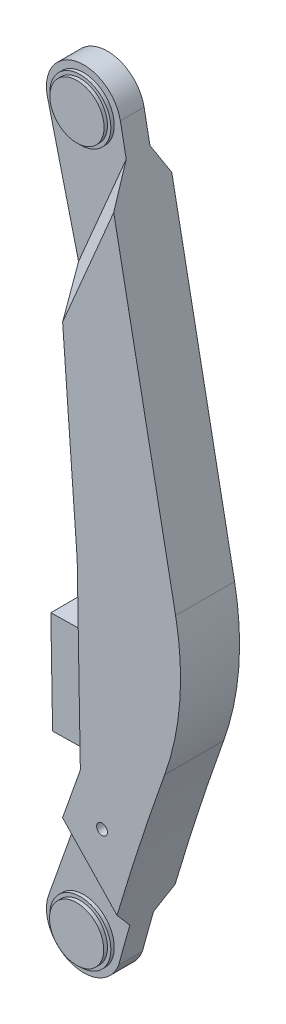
ISO-10303-21;
HEADER;
FILE_DESCRIPTION(('STEP AP214'),'2;1');
FILE_NAME('part.step','',(''),(''),'','','');
FILE_SCHEMA(('AUTOMOTIVE_DESIGN { 1 0 10303 214 1 1 1 1 }'));
ENDSEC;
DATA;
#1=APPLICATION_CONTEXT('core data for automotive mechanical design processes');
#2=APPLICATION_PROTOCOL_DEFINITION('international standard','automotive_design',2000,#1);
#3=PRODUCT_CONTEXT('',#1,'mechanical');
#4=PRODUCT('Part','Part','',(#3));
#5=PRODUCT_RELATED_PRODUCT_CATEGORY('part','',(#4));
#6=PRODUCT_DEFINITION_FORMATION('','',#4);
#7=PRODUCT_DEFINITION_CONTEXT('part definition',#1,'design');
#8=PRODUCT_DEFINITION('design','',#6,#7);
#9=PRODUCT_DEFINITION_SHAPE('','',#8);
#10=(LENGTH_UNIT() NAMED_UNIT(*) SI_UNIT(.MILLI.,.METRE.));
#11=(NAMED_UNIT(*) PLANE_ANGLE_UNIT() SI_UNIT($,.RADIAN.));
#12=(NAMED_UNIT(*) SI_UNIT($,.STERADIAN.) SOLID_ANGLE_UNIT());
#13=UNCERTAINTY_MEASURE_WITH_UNIT(LENGTH_MEASURE(1.E-05),#10,'distance_accuracy_value','');
#14=(GEOMETRIC_REPRESENTATION_CONTEXT(3) GLOBAL_UNCERTAINTY_ASSIGNED_CONTEXT((#13)) GLOBAL_UNIT_ASSIGNED_CONTEXT((#10,
#11,#12)) REPRESENTATION_CONTEXT('',''));
#15=CARTESIAN_POINT('',(0.,0.,0.));
#16=DIRECTION('',(0.,0.,1.));
#17=DIRECTION('',(1.,0.,0.));
#18=AXIS2_PLACEMENT_3D('',#15,#16,#17);
#19=CARTESIAN_POINT('',(52.8827555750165,50.,40.));
#20=DIRECTION('',(0.,0.,1.));
#21=DIRECTION('',(1.,0.,0.));
#22=AXIS2_PLACEMENT_3D('',#19,#20,#21);
#23=PLANE('',#22);
#24=CARTESIAN_POINT('',(52.8827555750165,50.,40.));
#25=DIRECTION('',(0.,0.,1.));
#26=DIRECTION('',(1.,0.,0.));
#27=AXIS2_PLACEMENT_3D('',#24,#25,#26);
#28=CIRCLE('',#27,45.);
#29=CARTESIAN_POINT('',(97.8827555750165,50.,40.));
#30=VERTEX_POINT('',#29);
#31=EDGE_CURVE('E247',#30,#30,#28,.T.);
#32=ORIENTED_EDGE('',*,*,#31,.T.);
#33=EDGE_LOOP('',(#32));
#34=FACE_BOUND('',#33,.T.);
#35=CARTESIAN_POINT('',(52.8827555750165,50.,40.));
#36=DIRECTION('',(0.,0.,1.));
#37=DIRECTION('',(1.,0.,0.));
#38=AXIS2_PLACEMENT_3D('',#35,#36,#37);
#39=CIRCLE('',#38,40.);
#40=CARTESIAN_POINT('',(92.8827555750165,50.,40.));
#41=VERTEX_POINT('',#40);
#42=EDGE_CURVE('E425',#41,#41,#39,.T.);
#43=ORIENTED_EDGE('',*,*,#42,.F.);
#44=EDGE_LOOP('',(#43));
#45=FACE_BOUND('',#44,.T.);
#46=ADVANCED_FACE('F15',(#34,#45),#23,.T.);
#47=CARTESIAN_POINT('',(52.8827555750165,50.,-5.));
#48=DIRECTION('',(0.,0.,1.));
#49=DIRECTION('',(1.,0.,0.));
#50=AXIS2_PLACEMENT_3D('',#47,#48,#49);
#51=PLANE('',#50);
#52=CARTESIAN_POINT('',(52.8827555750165,50.,-5.));
#53=DIRECTION('',(0.,0.,1.));
#54=DIRECTION('',(1.,0.,0.));
#55=AXIS2_PLACEMENT_3D('',#52,#53,#54);
#56=CIRCLE('',#55,45.);
#57=CARTESIAN_POINT('',(97.8827555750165,50.,-5.));
#58=VERTEX_POINT('',#57);
#59=EDGE_CURVE('E244',#58,#58,#56,.T.);
#60=ORIENTED_EDGE('',*,*,#59,.F.);
#61=EDGE_LOOP('',(#60));
#62=FACE_BOUND('',#61,.T.);
#63=CARTESIAN_POINT('',(52.8827555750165,50.,-5.));
#64=DIRECTION('',(0.,0.,1.));
#65=DIRECTION('',(1.,0.,0.));
#66=AXIS2_PLACEMENT_3D('',#63,#64,#65);
#67=CIRCLE('',#66,40.);
#68=CARTESIAN_POINT('',(92.8827555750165,50.,-5.));
#69=VERTEX_POINT('',#68);
#70=EDGE_CURVE('E9',#69,#69,#67,.F.);
#71=ORIENTED_EDGE('',*,*,#70,.F.);
#72=EDGE_LOOP('',(#71));
#73=FACE_BOUND('',#72,.T.);
#74=ADVANCED_FACE('F367',(#62,#73),#51,.F.);
#75=CARTESIAN_POINT('',(52.8827555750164,1100.,40.));
#76=DIRECTION('',(0.,0.,1.));
#77=DIRECTION('',(1.,0.,0.));
#78=AXIS2_PLACEMENT_3D('',#75,#76,#77);
#79=PLANE('',#78);
#80=CARTESIAN_POINT('',(52.8827555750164,1100.,40.));
#81=DIRECTION('',(0.,0.,1.));
#82=DIRECTION('',(1.,0.,0.));
#83=AXIS2_PLACEMENT_3D('',#80,#81,#82);
#84=CIRCLE('',#83,45.);
#85=CARTESIAN_POINT('',(97.8827555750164,1100.,40.));
#86=VERTEX_POINT('',#85);
#87=EDGE_CURVE('E259',#86,#86,#84,.T.);
#88=ORIENTED_EDGE('',*,*,#87,.T.);
#89=EDGE_LOOP('',(#88));
#90=FACE_BOUND('',#89,.T.);
#91=CARTESIAN_POINT('',(52.8827555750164,1100.,40.));
#92=DIRECTION('',(0.,0.,1.));
#93=DIRECTION('',(1.,0.,0.));
#94=AXIS2_PLACEMENT_3D('',#91,#92,#93);
#95=CIRCLE('',#94,40.);
#96=CARTESIAN_POINT('',(92.8827555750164,1100.,40.));
#97=VERTEX_POINT('',#96);
#98=EDGE_CURVE('E428',#97,#97,#95,.T.);
#99=ORIENTED_EDGE('',*,*,#98,.F.);
#100=EDGE_LOOP('',(#99));
#101=FACE_BOUND('',#100,.T.);
#102=ADVANCED_FACE('F355',(#90,#101),#79,.T.);
#103=CARTESIAN_POINT('',(52.8827555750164,1100.,-5.));
#104=DIRECTION('',(0.,0.,1.));
#105=DIRECTION('',(1.,0.,0.));
#106=AXIS2_PLACEMENT_3D('',#103,#104,#105);
#107=PLANE('',#106);
#108=CARTESIAN_POINT('',(52.8827555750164,1100.,-5.));
#109=DIRECTION('',(0.,0.,1.));
#110=DIRECTION('',(1.,0.,0.));
#111=AXIS2_PLACEMENT_3D('',#108,#109,#110);
#112=CIRCLE('',#111,45.);
#113=CARTESIAN_POINT('',(97.8827555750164,1100.,-5.));
#114=VERTEX_POINT('',#113);
#115=EDGE_CURVE('E256',#114,#114,#112,.T.);
#116=ORIENTED_EDGE('',*,*,#115,.F.);
#117=EDGE_LOOP('',(#116));
#118=FACE_BOUND('',#117,.T.);
#119=CARTESIAN_POINT('',(52.8827555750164,1100.,-5.));
#120=DIRECTION('',(0.,0.,1.));
#121=DIRECTION('',(1.,0.,0.));
#122=AXIS2_PLACEMENT_3D('',#119,#120,#121);
#123=CIRCLE('',#122,40.);
#124=CARTESIAN_POINT('',(92.8827555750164,1100.,-5.));
#125=VERTEX_POINT('',#124);
#126=EDGE_CURVE('E24',#125,#125,#123,.F.);
#127=ORIENTED_EDGE('',*,*,#126,.F.);
#128=EDGE_LOOP('',(#127));
#129=FACE_BOUND('',#128,.T.);
#130=ADVANCED_FACE('F353',(#118,#129),#107,.F.);
#131=CARTESIAN_POINT('',(71.231981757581,546.158587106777,35.));
#132=DIRECTION('',(0.999847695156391,0.0174524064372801,0.));
#133=DIRECTION('',(-0.0174524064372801,0.999847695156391,0.));
#134=AXIS2_PLACEMENT_3D('',#131,#132,#133);
#135=PLANE('',#134);
#136=DIRECTION('',(0.,0.,-1.));
#137=VECTOR('',#136,1.);
#138=CARTESIAN_POINT('',(71.231981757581,546.158587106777,35.));
#139=LINE('',#138,#137);
#140=CARTESIAN_POINT('',(71.2319817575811,546.158587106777,63.));
#141=VERTEX_POINT('',#140);
#142=CARTESIAN_POINT('',(71.2319817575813,546.158587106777,-24.));
#143=VERTEX_POINT('',#142);
#144=EDGE_CURVE('E307',#141,#143,#139,.T.);
#145=ORIENTED_EDGE('',*,*,#144,.T.);
#146=DIRECTION('',(0.0174524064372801,-0.999847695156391,0.));
#147=VECTOR('',#146,1.);
#148=CARTESIAN_POINT('',(71.2319817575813,546.158587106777,-24.));
#149=LINE('',#148,#147);
#150=CARTESIAN_POINT('',(75.8827555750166,279.715933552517,-24.));
#151=VERTEX_POINT('',#150);
#152=EDGE_CURVE('E225',#143,#151,#149,.T.);
#153=ORIENTED_EDGE('',*,*,#152,.T.);
#154=DIRECTION('',(0.,0.,-1.));
#155=VECTOR('',#154,1.);
#156=CARTESIAN_POINT('',(75.8827555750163,279.715933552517,35.));
#157=LINE('',#156,#155);
#158=CARTESIAN_POINT('',(75.8827555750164,279.715933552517,63.));
#159=VERTEX_POINT('',#158);
#160=EDGE_CURVE('E305',#159,#151,#157,.T.);
#161=ORIENTED_EDGE('',*,*,#160,.F.);
#162=DIRECTION('',(0.0174524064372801,-0.999847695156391,0.));
#163=VECTOR('',#162,1.);
#164=CARTESIAN_POINT('',(71.2319817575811,546.158587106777,63.));
#165=LINE('',#164,#163);
#166=EDGE_CURVE('E209',#141,#159,#165,.T.);
#167=ORIENTED_EDGE('',*,*,#166,.F.);
#168=EDGE_LOOP('',(#145,#153,#161,#167));
#169=FACE_BOUND('',#168,.T.);
#170=DIRECTION('',(-0.0174524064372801,0.999847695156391,0.));
#171=VECTOR('',#170,1.);
#172=CARTESIAN_POINT('',(72.8204454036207,455.155565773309,58.5));
#173=LINE('',#172,#171);
#174=CARTESIAN_POINT('',(75.4383063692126,305.17841149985,58.5));
#175=VERTEX_POINT('',#174);
#176=CARTESIAN_POINT('',(72.8204454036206,455.155565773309,58.5));
#177=VERTEX_POINT('',#176);
#178=EDGE_CURVE('E155',#175,#177,#173,.T.);
#179=ORIENTED_EDGE('',*,*,#178,.F.);
#180=DIRECTION('',(0.,0.,1.));
#181=VECTOR('',#180,1.);
#182=CARTESIAN_POINT('',(75.4383063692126,305.17841149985,58.5));
#183=LINE('',#182,#181);
#184=CARTESIAN_POINT('',(75.4383063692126,305.17841149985,8.5));
#185=VERTEX_POINT('',#184);
#186=EDGE_CURVE('E158',#185,#175,#183,.T.);
#187=ORIENTED_EDGE('',*,*,#186,.F.);
#188=DIRECTION('',(0.0174524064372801,-0.999847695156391,0.));
#189=VECTOR('',#188,1.);
#190=CARTESIAN_POINT('',(72.8204454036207,455.155565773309,8.5));
#191=LINE('',#190,#189);
#192=CARTESIAN_POINT('',(72.8204454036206,455.155565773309,8.5));
#193=VERTEX_POINT('',#192);
#194=EDGE_CURVE('E36',#193,#185,#191,.T.);
#195=ORIENTED_EDGE('',*,*,#194,.F.);
#196=DIRECTION('',(0.,0.,-1.));
#197=VECTOR('',#196,1.);
#198=CARTESIAN_POINT('',(72.8204454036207,455.155565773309,58.5));
#199=LINE('',#198,#197);
#200=EDGE_CURVE('E31',#177,#193,#199,.T.);
#201=ORIENTED_EDGE('',*,*,#200,.F.);
#202=EDGE_LOOP('',(#179,#187,#195,#201));
#203=FACE_BOUND('',#202,.T.);
#204=ADVANCED_FACE('F157',(#169,#203),#135,.F.);
#205=CARTESIAN_POINT('',(52.8827555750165,1100.,35.));
#206=DIRECTION('',(0.,0.,-1.));
#207=DIRECTION('',(-1.,0.,0.));
#208=AXIS2_PLACEMENT_3D('',#205,#206,#207);
#209=PLANE('',#208);
#210=CARTESIAN_POINT('',(52.8827555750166,50.,35.));
#211=DIRECTION('',(0.,0.,-1.));
#212=DIRECTION('',(-1.,0.,0.));
#213=AXIS2_PLACEMENT_3D('',#210,#211,#212);
#214=CIRCLE('',#213,45.);
#215=CARTESIAN_POINT('',(7.8827555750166,50.,35.));
#216=VERTEX_POINT('',#215);
#217=EDGE_CURVE('E251',#216,#216,#214,.F.);
#218=ORIENTED_EDGE('',*,*,#217,.F.);
#219=EDGE_LOOP('',(#218));
#220=FACE_BOUND('',#219,.T.);
#221=CARTESIAN_POINT('',(3965.40296443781,-1014.56231606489,35.));
#222=DIRECTION('',(0.,0.,-1.));
#223=DIRECTION('',(-1.,0.,0.));
#224=AXIS2_PLACEMENT_3D('',#221,#222,#223);
#225=CIRCLE('',#224,4000.);
#226=CARTESIAN_POINT('',(104.399725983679,30.738594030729,35.));
#227=VERTEX_POINT('',#226);
#228=CARTESIAN_POINT('',(120.933938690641,90.,35.));
#229=VERTEX_POINT('',#228);
#230=EDGE_CURVE('E291',#227,#229,#225,.T.);
#231=ORIENTED_EDGE('',*,*,#230,.T.);
#232=DIRECTION('',(-0.688952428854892,0.724806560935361,0.));
#233=VECTOR('',#232,1.);
#234=CARTESIAN_POINT('',(-415.717739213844,654.579847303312,35.));
#235=LINE('',#234,#233);
#236=CARTESIAN_POINT('',(39.1640010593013,176.025369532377,35.));
#237=VERTEX_POINT('',#236);
#238=EDGE_CURVE('E242',#229,#237,#235,.T.);
#239=ORIENTED_EDGE('',*,*,#238,.T.);
#240=DIRECTION('',(-0.333806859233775,-0.942641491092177,0.));
#241=VECTOR('',#240,1.);
#242=CARTESIAN_POINT('',(75.8827555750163,279.715933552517,35.));
#243=LINE('',#242,#241);
#244=CARTESIAN_POINT('',(1.03747356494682,68.3593772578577,35.));
#245=VERTEX_POINT('',#244);
#246=EDGE_CURVE('E287',#237,#245,#243,.T.);
#247=ORIENTED_EDGE('',*,*,#246,.T.);
#248=CARTESIAN_POINT('',(52.8827555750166,50.,35.));
#249=DIRECTION('',(0.,0.,1.));
#250=DIRECTION('',(1.,0.,0.));
#251=AXIS2_PLACEMENT_3D('',#248,#249,#250);
#252=CIRCLE('',#251,55.);
#253=EDGE_CURVE('E289',#245,#227,#252,.T.);
#254=ORIENTED_EDGE('',*,*,#253,.T.);
#255=EDGE_LOOP('',(#231,#239,#247,#254));
#256=FACE_BOUND('',#255,.T.);
#257=ADVANCED_FACE('F364',(#220,#256),#209,.F.);
#258=CARTESIAN_POINT('',(52.8827555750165,1100.,0.));
#259=DIRECTION('',(0.,0.,-1.));
#260=DIRECTION('',(-1.,0.,0.));
#261=AXIS2_PLACEMENT_3D('',#258,#259,#260);
#262=PLANE('',#261);
#263=DIRECTION('',(-0.688952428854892,0.724806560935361,0.));
#264=VECTOR('',#263,1.);
#265=CARTESIAN_POINT('',(-415.717739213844,654.579847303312,0.));
#266=LINE('',#265,#264);
#267=CARTESIAN_POINT('',(120.933938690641,90.,0.));
#268=VERTEX_POINT('',#267);
#269=CARTESIAN_POINT('',(39.1640010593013,176.025369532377,0.));
#270=VERTEX_POINT('',#269);
#271=EDGE_CURVE('E239',#268,#270,#266,.T.);
#272=ORIENTED_EDGE('',*,*,#271,.F.);
#273=CARTESIAN_POINT('',(3965.40296443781,-1014.56231606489,0.));
#274=DIRECTION('',(0.,0.,-1.));
#275=DIRECTION('',(-1.,0.,0.));
#276=AXIS2_PLACEMENT_3D('',#273,#274,#275);
#277=CIRCLE('',#276,4000.);
#278=CARTESIAN_POINT('',(104.399725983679,30.738594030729,0.));
#279=VERTEX_POINT('',#278);
#280=EDGE_CURVE('E276',#279,#268,#277,.T.);
#281=ORIENTED_EDGE('',*,*,#280,.F.);
#282=CARTESIAN_POINT('',(52.8827555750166,50.,0.));
#283=DIRECTION('',(0.,0.,1.));
#284=DIRECTION('',(1.,0.,0.));
#285=AXIS2_PLACEMENT_3D('',#282,#283,#284);
#286=CIRCLE('',#285,55.);
#287=CARTESIAN_POINT('',(1.03747356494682,68.3593772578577,0.));
#288=VERTEX_POINT('',#287);
#289=EDGE_CURVE('E274',#288,#279,#286,.T.);
#290=ORIENTED_EDGE('',*,*,#289,.F.);
#291=DIRECTION('',(-0.333806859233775,-0.942641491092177,0.));
#292=VECTOR('',#291,1.);
#293=CARTESIAN_POINT('',(75.8827555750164,279.715933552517,0.));
#294=LINE('',#293,#292);
#295=EDGE_CURVE('E272',#270,#288,#294,.T.);
#296=ORIENTED_EDGE('',*,*,#295,.F.);
#297=EDGE_LOOP('',(#272,#281,#290,#296));
#298=FACE_BOUND('',#297,.T.);
#299=CARTESIAN_POINT('',(52.8827555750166,50.,0.));
#300=DIRECTION('',(0.,0.,-1.));
#301=DIRECTION('',(-1.,0.,0.));
#302=AXIS2_PLACEMENT_3D('',#299,#300,#301);
#303=CIRCLE('',#302,45.);
#304=CARTESIAN_POINT('',(7.8827555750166,50.,0.));
#305=VERTEX_POINT('',#304);
#306=EDGE_CURVE('E250',#305,#305,#303,.F.);
#307=ORIENTED_EDGE('',*,*,#306,.T.);
#308=EDGE_LOOP('',(#307));
#309=FACE_BOUND('',#308,.T.);
#310=ADVANCED_FACE('F520',(#298,#309),#262,.T.);
#311=CARTESIAN_POINT('',(52.8827555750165,1100.,35.));
#312=DIRECTION('',(0.,0.,-1.));
#313=DIRECTION('',(-1.,0.,0.));
#314=AXIS2_PLACEMENT_3D('',#311,#312,#313);
#315=CIRCLE('',#314,45.);
#316=CARTESIAN_POINT('',(7.88275557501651,1100.,35.));
#317=VERTEX_POINT('',#316);
#318=EDGE_CURVE('E255',#317,#317,#315,.F.);
#319=ORIENTED_EDGE('',*,*,#318,.F.);
#320=EDGE_LOOP('',(#319));
#321=FACE_BOUND('',#320,.T.);
#322=DIRECTION('',(0.23791992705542,-0.971284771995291,0.));
#323=VECTOR('',#322,1.);
#324=CARTESIAN_POINT('',(-0.537906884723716,1086.91440401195,35.));
#325=LINE('',#324,#323);
#326=CARTESIAN_POINT('',(-0.537906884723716,1086.91440401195,35.));
#327=VERTEX_POINT('',#326);
#328=CARTESIAN_POINT('',(45.2474926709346,900.,35.));
#329=VERTEX_POINT('',#328);
#330=EDGE_CURVE('E284',#327,#329,#325,.T.);
#331=ORIENTED_EDGE('',*,*,#330,.T.);
#332=DIRECTION('',(0.390731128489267,0.920504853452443,0.));
#333=VECTOR('',#332,1.);
#334=CARTESIAN_POINT('',(118.347154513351,1072.21201129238,35.));
#335=LINE('',#334,#333);
#336=CARTESIAN_POINT('',(115.580533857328,1065.69426147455,35.));
#337=VERTEX_POINT('',#336);
#338=EDGE_CURVE('E236',#329,#337,#335,.T.);
#339=ORIENTED_EDGE('',*,*,#338,.T.);
#340=DIRECTION('',(-0.190808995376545,0.981627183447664,0.));
#341=VECTOR('',#340,1.);
#342=CARTESIAN_POINT('',(106.872250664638,1110.49449474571,35.));
#343=LINE('',#342,#341);
#344=CARTESIAN_POINT('',(106.872250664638,1110.49449474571,35.));
#345=VERTEX_POINT('',#344);
#346=EDGE_CURVE('E294',#337,#345,#343,.T.);
#347=ORIENTED_EDGE('',*,*,#346,.T.);
#348=CARTESIAN_POINT('',(52.8827555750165,1100.,35.));
#349=DIRECTION('',(0.,0.,1.));
#350=DIRECTION('',(-1.,0.,0.));
#351=AXIS2_PLACEMENT_3D('',#348,#349,#350);
#352=CIRCLE('',#351,55.);
#353=EDGE_CURVE('E281',#345,#327,#352,.T.);
#354=ORIENTED_EDGE('',*,*,#353,.T.);
#355=EDGE_LOOP('',(#331,#339,#347,#354));
#356=FACE_BOUND('',#355,.T.);
#357=ADVANCED_FACE('F560',(#321,#356),#209,.F.);
#358=DIRECTION('',(0.390731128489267,0.920504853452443,0.));
#359=VECTOR('',#358,1.);
#360=CARTESIAN_POINT('',(118.347154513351,1072.21201129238,0.));
#361=LINE('',#360,#359);
#362=CARTESIAN_POINT('',(45.2474926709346,900.,0.));
#363=VERTEX_POINT('',#362);
#364=CARTESIAN_POINT('',(115.580533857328,1065.69426147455,0.));
#365=VERTEX_POINT('',#364);
#366=EDGE_CURVE('E233',#363,#365,#361,.T.);
#367=ORIENTED_EDGE('',*,*,#366,.F.);
#368=DIRECTION('',(0.23791992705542,-0.971284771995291,0.));
#369=VECTOR('',#368,1.);
#370=CARTESIAN_POINT('',(-0.537906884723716,1086.91440401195,0.));
#371=LINE('',#370,#369);
#372=CARTESIAN_POINT('',(-0.537906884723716,1086.91440401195,0.));
#373=VERTEX_POINT('',#372);
#374=EDGE_CURVE('E269',#373,#363,#371,.T.);
#375=ORIENTED_EDGE('',*,*,#374,.F.);
#376=CARTESIAN_POINT('',(52.8827555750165,1100.,0.));
#377=DIRECTION('',(0.,0.,1.));
#378=DIRECTION('',(-1.,0.,0.));
#379=AXIS2_PLACEMENT_3D('',#376,#377,#378);
#380=CIRCLE('',#379,55.);
#381=CARTESIAN_POINT('',(106.872250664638,1110.49449474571,0.));
#382=VERTEX_POINT('',#381);
#383=EDGE_CURVE('E266',#382,#373,#380,.T.);
#384=ORIENTED_EDGE('',*,*,#383,.F.);
#385=DIRECTION('',(-0.190808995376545,0.981627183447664,0.));
#386=VECTOR('',#385,1.);
#387=CARTESIAN_POINT('',(106.872250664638,1110.49449474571,0.));
#388=LINE('',#387,#386);
#389=EDGE_CURVE('E279',#365,#382,#388,.T.);
#390=ORIENTED_EDGE('',*,*,#389,.F.);
#391=EDGE_LOOP('',(#367,#375,#384,#390));
#392=FACE_BOUND('',#391,.T.);
#393=CARTESIAN_POINT('',(52.8827555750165,1100.,0.));
#394=DIRECTION('',(0.,0.,-1.));
#395=DIRECTION('',(-1.,0.,0.));
#396=AXIS2_PLACEMENT_3D('',#393,#394,#395);
#397=CIRCLE('',#396,45.);
#398=CARTESIAN_POINT('',(7.88275557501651,1100.,0.));
#399=VERTEX_POINT('',#398);
#400=EDGE_CURVE('E262',#399,#399,#397,.F.);
#401=ORIENTED_EDGE('',*,*,#400,.T.);
#402=EDGE_LOOP('',(#401));
#403=FACE_BOUND('',#402,.T.);
#404=ADVANCED_FACE('F551',(#392,#403),#262,.T.);
#405=CARTESIAN_POINT('',(52.8827555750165,1100.,35.));
#406=DIRECTION('',(0.,0.,-1.));
#407=DIRECTION('',(-1.,0.,0.));
#408=AXIS2_PLACEMENT_3D('',#405,#406,#407);
#409=CYLINDRICAL_SURFACE('',#408,55.);
#410=ORIENTED_EDGE('',*,*,#383,.T.);
#411=DIRECTION('',(0.,0.,-1.));
#412=VECTOR('',#411,1.);
#413=CARTESIAN_POINT('',(-0.537906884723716,1086.91440401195,35.));
#414=LINE('',#413,#412);
#415=EDGE_CURVE('E313',#327,#373,#414,.T.);
#416=ORIENTED_EDGE('',*,*,#415,.F.);
#417=ORIENTED_EDGE('',*,*,#353,.F.);
#418=DIRECTION('',(0.,0.,-1.));
#419=VECTOR('',#418,1.);
#420=CARTESIAN_POINT('',(106.872250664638,1110.49449474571,35.));
#421=LINE('',#420,#419);
#422=EDGE_CURVE('E296',#345,#382,#421,.T.);
#423=ORIENTED_EDGE('',*,*,#422,.T.);
#424=EDGE_LOOP('',(#410,#416,#417,#423));
#425=FACE_BOUND('',#424,.T.);
#426=ADVANCED_FACE('F17',(#425),#409,.T.);
#427=CARTESIAN_POINT('',(-0.537906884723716,1086.91440401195,35.));
#428=DIRECTION('',(0.971284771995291,0.23791992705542,0.));
#429=DIRECTION('',(-0.23791992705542,0.971284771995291,0.));
#430=AXIS2_PLACEMENT_3D('',#427,#428,#429);
#431=PLANE('',#430);
#432=ORIENTED_EDGE('',*,*,#374,.T.);
#433=DIRECTION('',(0.,0.,-1.));
#434=VECTOR('',#433,1.);
#435=CARTESIAN_POINT('',(45.2474926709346,900.,35.));
#436=LINE('',#435,#434);
#437=EDGE_CURVE('E310',#329,#363,#436,.T.);
#438=ORIENTED_EDGE('',*,*,#437,.F.);
#439=ORIENTED_EDGE('',*,*,#330,.F.);
#440=ORIENTED_EDGE('',*,*,#415,.T.);
#441=EDGE_LOOP('',(#432,#438,#439,#440));
#442=FACE_BOUND('',#441,.T.);
#443=ADVANCED_FACE('F565',(#442),#431,.F.);
#444=CARTESIAN_POINT('',(45.2474926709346,900.,35.));
#445=DIRECTION('',(0.997314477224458,0.0732381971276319,0.));
#446=DIRECTION('',(-0.0732381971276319,0.997314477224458,0.));
#447=AXIS2_PLACEMENT_3D('',#444,#445,#446);
#448=PLANE('',#447);
#449=DIRECTION('',(0.0732381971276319,-0.997314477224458,0.));
#450=VECTOR('',#449,1.);
#451=CARTESIAN_POINT('',(45.2474926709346,900.,63.));
#452=LINE('',#451,#450);
#453=CARTESIAN_POINT('',(49.7337731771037,838.908483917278,63.));
#454=VERTEX_POINT('',#453);
#455=EDGE_CURVE('E207',#454,#141,#452,.T.);
#456=ORIENTED_EDGE('',*,*,#455,.F.);
#457=DIRECTION('',(0.0666094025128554,-0.907047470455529,0.415725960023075));
#458=VECTOR('',#457,1.);
#459=CARTESIAN_POINT('',(72.7469435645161,525.5287327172,206.630958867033));
#460=LINE('',#459,#458);
#461=EDGE_CURVE('E341',#454,#329,#460,.F.);
#462=ORIENTED_EDGE('',*,*,#461,.T.);
#463=ORIENTED_EDGE('',*,*,#437,.T.);
#464=DIRECTION('',(0.0666094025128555,-0.90704747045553,-0.415725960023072));
#465=VECTOR('',#464,1.);
#466=CARTESIAN_POINT('',(35.5486495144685,1032.0731130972,60.5329087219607));
#467=LINE('',#466,#465);
#468=CARTESIAN_POINT('',(49.0928759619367,847.635843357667,-24.));
#469=VERTEX_POINT('',#468);
#470=EDGE_CURVE('E331',#363,#469,#467,.T.);
#471=ORIENTED_EDGE('',*,*,#470,.T.);
#472=DIRECTION('',(0.0732381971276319,-0.997314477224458,0.));
#473=VECTOR('',#472,1.);
#474=CARTESIAN_POINT('',(45.2474926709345,900.,-24.));
#475=LINE('',#474,#473);
#476=EDGE_CURVE('E223',#469,#143,#475,.T.);
#477=ORIENTED_EDGE('',*,*,#476,.T.);
#478=ORIENTED_EDGE('',*,*,#144,.F.);
#479=EDGE_LOOP('',(#456,#462,#463,#471,#477,#478));
#480=FACE_BOUND('',#479,.T.);
#481=ADVANCED_FACE('F563',(#480),#448,.F.);
#482=CARTESIAN_POINT('',(75.8827555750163,279.715933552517,35.));
#483=DIRECTION('',(0.942641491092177,-0.333806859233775,0.));
#484=DIRECTION('',(0.333806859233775,0.942641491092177,0.));
#485=AXIS2_PLACEMENT_3D('',#482,#483,#484);
#486=PLANE('',#485);
#487=ORIENTED_EDGE('',*,*,#246,.F.);
#488=DIRECTION('',(-0.249181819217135,-0.703667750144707,-0.665402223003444));
#489=VECTOR('',#488,1.);
#490=CARTESIAN_POINT('',(78.9799095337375,288.462026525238,141.322339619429));
#491=LINE('',#490,#489);
#492=CARTESIAN_POINT('',(49.6495249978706,205.635575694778,63.));
#493=VERTEX_POINT('',#492);
#494=EDGE_CURVE('E347',#237,#493,#491,.F.);
#495=ORIENTED_EDGE('',*,*,#494,.T.);
#496=DIRECTION('',(-0.333806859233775,-0.942641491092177,0.));
#497=VECTOR('',#496,1.);
#498=CARTESIAN_POINT('',(75.8827555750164,279.715933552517,63.));
#499=LINE('',#498,#497);
#500=EDGE_CURVE('E212',#159,#493,#499,.T.);
#501=ORIENTED_EDGE('',*,*,#500,.F.);
#502=ORIENTED_EDGE('',*,*,#160,.T.);
#503=DIRECTION('',(-0.333806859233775,-0.942641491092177,0.));
#504=VECTOR('',#503,1.);
#505=CARTESIAN_POINT('',(75.8827555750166,279.715933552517,-24.));
#506=LINE('',#505,#504);
#507=CARTESIAN_POINT('',(48.1515930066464,201.405546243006,-24.));
#508=VERTEX_POINT('',#507);
#509=EDGE_CURVE('E228',#151,#508,#506,.T.);
#510=ORIENTED_EDGE('',*,*,#509,.T.);
#511=DIRECTION('',(-0.249181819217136,-0.703667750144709,0.665402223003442));
#512=VECTOR('',#511,1.);
#513=CARTESIAN_POINT('',(29.157433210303,147.767693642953,26.7210204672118));
#514=LINE('',#513,#512);
#515=EDGE_CURVE('E329',#508,#270,#514,.T.);
#516=ORIENTED_EDGE('',*,*,#515,.T.);
#517=ORIENTED_EDGE('',*,*,#295,.T.);
#518=DIRECTION('',(0.,0.,-1.));
#519=VECTOR('',#518,1.);
#520=CARTESIAN_POINT('',(1.03747356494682,68.3593772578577,35.));
#521=LINE('',#520,#519);
#522=EDGE_CURVE('E302',#245,#288,#521,.T.);
#523=ORIENTED_EDGE('',*,*,#522,.F.);
#524=EDGE_LOOP('',(#487,#495,#501,#502,#510,#516,#517,#523));
#525=FACE_BOUND('',#524,.T.);
#526=ADVANCED_FACE('F516',(#525),#486,.F.);
#527=CARTESIAN_POINT('',(52.8827555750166,50.,35.));
#528=DIRECTION('',(0.,0.,-1.));
#529=DIRECTION('',(-1.,0.,0.));
#530=AXIS2_PLACEMENT_3D('',#527,#528,#529);
#531=CYLINDRICAL_SURFACE('',#530,55.);
#532=ORIENTED_EDGE('',*,*,#289,.T.);
#533=DIRECTION('',(0.,0.,-1.));
#534=VECTOR('',#533,1.);
#535=CARTESIAN_POINT('',(104.399725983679,30.738594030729,35.));
#536=LINE('',#535,#534);
#537=EDGE_CURVE('E299',#227,#279,#536,.T.);
#538=ORIENTED_EDGE('',*,*,#537,.F.);
#539=ORIENTED_EDGE('',*,*,#253,.F.);
#540=ORIENTED_EDGE('',*,*,#522,.T.);
#541=EDGE_LOOP('',(#532,#538,#539,#540));
#542=FACE_BOUND('',#541,.T.);
#543=ADVANCED_FACE('F525',(#542),#531,.T.);
#544=CARTESIAN_POINT('',(3965.40296443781,-1014.56231606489,35.));
#545=DIRECTION('',(0.,0.,-1.));
#546=DIRECTION('',(-1.,0.,0.));
#547=AXIS2_PLACEMENT_3D('',#544,#545,#546);
#548=CYLINDRICAL_SURFACE('',#547,4000.);
#549=CARTESIAN_POINT('',(3965.40296443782,-1014.56231606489,63.));
#550=DIRECTION('',(0.,0.,-1.));
#551=DIRECTION('',(1.,0.,0.));
#552=AXIS2_PLACEMENT_3D('',#549,#550,#551);
#553=CIRCLE('',#552,4000.);
#554=CARTESIAN_POINT('',(130.005251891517,121.098014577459,63.));
#555=VERTEX_POINT('',#554);
#556=CARTESIAN_POINT('',(200.236073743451,335.814773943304,63.));
#557=VERTEX_POINT('',#556);
#558=EDGE_CURVE('E215',#555,#557,#553,.T.);
#559=ORIENTED_EDGE('',*,*,#558,.F.);
#560=CARTESIAN_POINT('',(3965.40296443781,-1014.56231606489,2060.50548269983));
#561=DIRECTION('',(0.512515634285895,0.487162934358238,-0.707106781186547));
#562=DIRECTION('',(-0.512515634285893,-0.487162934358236,-0.707106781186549));
#563=AXIS2_PLACEMENT_3D('',#560,#561,#562);
#564=ELLIPSE('',#563,5656.85424949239,4000.);
#565=EDGE_CURVE('E345',#555,#229,#564,.F.);
#566=ORIENTED_EDGE('',*,*,#565,.T.);
#567=ORIENTED_EDGE('',*,*,#230,.F.);
#568=ORIENTED_EDGE('',*,*,#537,.T.);
#569=ORIENTED_EDGE('',*,*,#280,.T.);
#570=CARTESIAN_POINT('',(3965.40296443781,-1014.56231606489,-2025.50548269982));
#571=DIRECTION('',(-0.512515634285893,-0.487162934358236,-0.707106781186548));
#572=DIRECTION('',(0.512515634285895,0.487162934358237,-0.707106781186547));
#573=AXIS2_PLACEMENT_3D('',#570,#571,#572);
#574=ELLIPSE('',#573,5656.85424949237,4000.);
#575=CARTESIAN_POINT('',(128.696569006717,116.668887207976,-24.));
#576=VERTEX_POINT('',#575);
#577=EDGE_CURVE('E254',#268,#576,#574,.T.);
#578=ORIENTED_EDGE('',*,*,#577,.T.);
#579=CARTESIAN_POINT('',(3965.40296443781,-1014.56231606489,-24.));
#580=DIRECTION('',(0.,0.,-1.));
#581=DIRECTION('',(1.,0.,0.));
#582=AXIS2_PLACEMENT_3D('',#579,#580,#581);
#583=CIRCLE('',#582,4000.);
#584=CARTESIAN_POINT('',(200.236073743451,335.814773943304,-24.));
#585=VERTEX_POINT('',#584);
#586=EDGE_CURVE('E231',#576,#585,#583,.T.);
#587=ORIENTED_EDGE('',*,*,#586,.T.);
#588=DIRECTION('',(0.,0.,-1.));
#589=VECTOR('',#588,1.);
#590=CARTESIAN_POINT('',(200.23607374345,335.814773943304,35.));
#591=LINE('',#590,#589);
#592=EDGE_CURVE('E265',#585,#557,#591,.F.);
#593=ORIENTED_EDGE('',*,*,#592,.T.);
#594=EDGE_LOOP('',(#559,#566,#567,#568,#569,#578,#587,#593));
#595=FACE_BOUND('',#594,.T.);
#596=ADVANCED_FACE('F529',(#595),#548,.F.);
#597=CARTESIAN_POINT('',(106.872250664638,1110.49449474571,35.));
#598=DIRECTION('',(-0.981627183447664,-0.190808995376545,0.));
#599=DIRECTION('',(0.190808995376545,-0.981627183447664,0.));
#600=AXIS2_PLACEMENT_3D('',#597,#598,#599);
#601=PLANE('',#600);
#602=ORIENTED_EDGE('',*,*,#346,.F.);
#603=DIRECTION('',(-0.166539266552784,0.85677025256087,-0.488067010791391));
#604=VECTOR('',#603,1.);
#605=CARTESIAN_POINT('',(199.858386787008,632.122294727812,281.988236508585));
#606=LINE('',#605,#604);
#607=CARTESIAN_POINT('',(125.134753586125,1016.5420619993,63.));
#608=VERTEX_POINT('',#607);
#609=EDGE_CURVE('E343',#337,#608,#606,.F.);
#610=ORIENTED_EDGE('',*,*,#609,.T.);
#611=DIRECTION('',(-0.190808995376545,0.981627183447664,0.));
#612=VECTOR('',#611,1.);
#613=CARTESIAN_POINT('',(216.370258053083,547.176081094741,63.));
#614=LINE('',#613,#612);
#615=CARTESIAN_POINT('',(216.370258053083,547.176081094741,63.));
#616=VERTEX_POINT('',#615);
#617=EDGE_CURVE('E204',#616,#608,#614,.T.);
#618=ORIENTED_EDGE('',*,*,#617,.F.);
#619=DIRECTION('',(0.,0.,-1.));
#620=VECTOR('',#619,1.);
#621=CARTESIAN_POINT('',(216.370258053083,547.176081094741,35.));
#622=LINE('',#621,#620);
#623=CARTESIAN_POINT('',(216.370258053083,547.176081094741,-24.));
#624=VERTEX_POINT('',#623);
#625=EDGE_CURVE('E316',#616,#624,#622,.T.);
#626=ORIENTED_EDGE('',*,*,#625,.T.);
#627=DIRECTION('',(-0.190808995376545,0.981627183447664,0.));
#628=VECTOR('',#627,1.);
#629=CARTESIAN_POINT('',(216.370258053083,547.176081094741,-24.));
#630=LINE('',#629,#628);
#631=CARTESIAN_POINT('',(123.76986505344,1023.56380478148,-24.));
#632=VERTEX_POINT('',#631);
#633=EDGE_CURVE('E220',#624,#632,#630,.T.);
#634=ORIENTED_EDGE('',*,*,#633,.T.);
#635=DIRECTION('',(-0.166539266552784,0.856770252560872,0.488067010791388));
#636=VECTOR('',#635,1.);
#637=CARTESIAN_POINT('',(115.580533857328,1065.69426147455,0.));
#638=LINE('',#637,#636);
#639=EDGE_CURVE('E333',#632,#365,#638,.T.);
#640=ORIENTED_EDGE('',*,*,#639,.T.);
#641=ORIENTED_EDGE('',*,*,#389,.T.);
#642=ORIENTED_EDGE('',*,*,#422,.F.);
#643=EDGE_LOOP('',(#602,#610,#618,#626,#634,#640,#641,#642));
#644=FACE_BOUND('',#643,.T.);
#645=ADVANCED_FACE('F547',(#644),#601,.F.);
#646=CARTESIAN_POINT('',(-176.280615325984,470.852482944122,35.));
#647=DIRECTION('',(0.,0.,-1.));
#648=DIRECTION('',(-1.,0.,0.));
#649=AXIS2_PLACEMENT_3D('',#646,#647,#648);
#650=CYLINDRICAL_SURFACE('',#649,400.);
#651=ORIENTED_EDGE('',*,*,#625,.F.);
#652=CARTESIAN_POINT('',(-176.280615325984,470.852482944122,63.));
#653=DIRECTION('',(0.,0.,1.));
#654=DIRECTION('',(1.,0.,0.));
#655=AXIS2_PLACEMENT_3D('',#652,#653,#654);
#656=CIRCLE('',#655,400.);
#657=EDGE_CURVE('E201',#557,#616,#656,.T.);
#658=ORIENTED_EDGE('',*,*,#657,.F.);
#659=ORIENTED_EDGE('',*,*,#592,.F.);
#660=CARTESIAN_POINT('',(-176.280615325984,470.852482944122,-24.));
#661=DIRECTION('',(0.,0.,1.));
#662=DIRECTION('',(1.,0.,0.));
#663=AXIS2_PLACEMENT_3D('',#660,#661,#662);
#664=CIRCLE('',#663,400.);
#665=EDGE_CURVE('E217',#585,#624,#664,.T.);
#666=ORIENTED_EDGE('',*,*,#665,.T.);
#667=EDGE_LOOP('',(#651,#658,#659,#666));
#668=FACE_BOUND('',#667,.T.);
#669=ADVANCED_FACE('F582',(#668),#650,.T.);
#670=CARTESIAN_POINT('',(52.8827555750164,1100.,40.));
#671=DIRECTION('',(0.,0.,-1.));
#672=DIRECTION('',(-1.,0.,0.));
#673=AXIS2_PLACEMENT_3D('',#670,#671,#672);
#674=CYLINDRICAL_SURFACE('',#673,45.);
#675=ORIENTED_EDGE('',*,*,#400,.F.);
#676=EDGE_LOOP('',(#675));
#677=FACE_BOUND('',#676,.T.);
#678=ORIENTED_EDGE('',*,*,#115,.T.);
#679=EDGE_LOOP('',(#678));
#680=FACE_BOUND('',#679,.T.);
#681=ADVANCED_FACE('F395',(#677,#680),#674,.T.);
#682=ORIENTED_EDGE('',*,*,#87,.F.);
#683=EDGE_LOOP('',(#682));
#684=FACE_BOUND('',#683,.T.);
#685=ORIENTED_EDGE('',*,*,#318,.T.);
#686=EDGE_LOOP('',(#685));
#687=FACE_BOUND('',#686,.T.);
#688=ADVANCED_FACE('F386',(#684,#687),#674,.T.);
#689=CARTESIAN_POINT('',(52.8827555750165,50.,40.));
#690=DIRECTION('',(0.,0.,-1.));
#691=DIRECTION('',(-1.,0.,0.));
#692=AXIS2_PLACEMENT_3D('',#689,#690,#691);
#693=CYLINDRICAL_SURFACE('',#692,45.);
#694=ORIENTED_EDGE('',*,*,#306,.F.);
#695=EDGE_LOOP('',(#694));
#696=FACE_BOUND('',#695,.T.);
#697=ORIENTED_EDGE('',*,*,#59,.T.);
#698=EDGE_LOOP('',(#697));
#699=FACE_BOUND('',#698,.T.);
#700=ADVANCED_FACE('F383',(#696,#699),#693,.T.);
#701=ORIENTED_EDGE('',*,*,#31,.F.);
#702=EDGE_LOOP('',(#701));
#703=FACE_BOUND('',#702,.T.);
#704=ORIENTED_EDGE('',*,*,#217,.T.);
#705=EDGE_LOOP('',(#704));
#706=FACE_BOUND('',#705,.T.);
#707=ADVANCED_FACE('F385',(#703,#706),#693,.T.);
#708=CARTESIAN_POINT('',(-176.280615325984,470.852482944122,-24.));
#709=DIRECTION('',(0.,0.,1.));
#710=DIRECTION('',(1.,0.,0.));
#711=AXIS2_PLACEMENT_3D('',#708,#709,#710);
#712=PLANE('',#711);
#713=ORIENTED_EDGE('',*,*,#586,.F.);
#714=DIRECTION('',(-0.688952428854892,0.724806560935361,0.));
#715=VECTOR('',#714,1.);
#716=CARTESIAN_POINT('',(56.55935852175,192.560227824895,-24.));
#717=LINE('',#716,#715);
#718=EDGE_CURVE('E327',#576,#508,#717,.T.);
#719=ORIENTED_EDGE('',*,*,#718,.T.);
#720=ORIENTED_EDGE('',*,*,#509,.F.);
#721=ORIENTED_EDGE('',*,*,#152,.F.);
#722=ORIENTED_EDGE('',*,*,#476,.F.);
#723=DIRECTION('',(0.390731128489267,0.920504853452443,0.));
#724=VECTOR('',#723,1.);
#725=CARTESIAN_POINT('',(137.672650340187,1056.31671439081,-24.));
#726=LINE('',#725,#724);
#727=EDGE_CURVE('E325',#469,#632,#726,.T.);
#728=ORIENTED_EDGE('',*,*,#727,.T.);
#729=ORIENTED_EDGE('',*,*,#633,.F.);
#730=ORIENTED_EDGE('',*,*,#665,.F.);
#731=EDGE_LOOP('',(#713,#719,#720,#721,#722,#728,#729,#730));
#732=FACE_BOUND('',#731,.T.);
#733=ADVANCED_FACE('F393',(#732),#712,.F.);
#734=CARTESIAN_POINT('',(-176.280615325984,470.852482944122,63.));
#735=DIRECTION('',(0.,0.,1.));
#736=DIRECTION('',(1.,0.,0.));
#737=AXIS2_PLACEMENT_3D('',#734,#735,#736);
#738=PLANE('',#737);
#739=CARTESIAN_POINT('',(107.882755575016,220.,63.));
#740=DIRECTION('',(0.,0.,1.));
#741=DIRECTION('',(1.,0.,0.));
#742=AXIS2_PLACEMENT_3D('',#739,#740,#741);
#743=CIRCLE('',#742,8.);
#744=CARTESIAN_POINT('',(115.882755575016,220.,63.));
#745=VERTEX_POINT('',#744);
#746=EDGE_CURVE('E417',#745,#745,#743,.T.);
#747=ORIENTED_EDGE('',*,*,#746,.F.);
#748=EDGE_LOOP('',(#747));
#749=FACE_BOUND('',#748,.T.);
#750=ORIENTED_EDGE('',*,*,#617,.T.);
#751=DIRECTION('',(-0.390731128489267,-0.920504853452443,0.));
#752=VECTOR('',#751,1.);
#753=CARTESIAN_POINT('',(-117.150692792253,445.753319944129,63.));
#754=LINE('',#753,#752);
#755=EDGE_CURVE('E338',#608,#454,#754,.T.);
#756=ORIENTED_EDGE('',*,*,#755,.T.);
#757=ORIENTED_EDGE('',*,*,#455,.T.);
#758=ORIENTED_EDGE('',*,*,#166,.T.);
#759=ORIENTED_EDGE('',*,*,#500,.T.);
#760=DIRECTION('',(0.688952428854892,-0.724806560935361,0.));
#761=VECTOR('',#760,1.);
#762=CARTESIAN_POINT('',(-190.027430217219,457.785684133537,63.));
#763=LINE('',#762,#761);
#764=EDGE_CURVE('E335',#493,#555,#763,.T.);
#765=ORIENTED_EDGE('',*,*,#764,.T.);
#766=ORIENTED_EDGE('',*,*,#558,.T.);
#767=ORIENTED_EDGE('',*,*,#657,.T.);
#768=EDGE_LOOP('',(#750,#756,#757,#758,#759,#765,#766,#767));
#769=FACE_BOUND('',#768,.T.);
#770=ADVANCED_FACE('F495',(#749,#769),#738,.T.);
#771=CARTESIAN_POINT('',(120.933938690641,90.,0.));
#772=DIRECTION('',(-0.512515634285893,-0.487162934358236,-0.707106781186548));
#773=DIRECTION('',(-0.809684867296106,0.,0.586864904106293));
#774=AXIS2_PLACEMENT_3D('',#771,#772,#773);
#775=PLANE('',#774);
#776=ORIENTED_EDGE('',*,*,#515,.F.);
#777=ORIENTED_EDGE('',*,*,#718,.F.);
#778=ORIENTED_EDGE('',*,*,#577,.F.);
#779=ORIENTED_EDGE('',*,*,#271,.T.);
#780=EDGE_LOOP('',(#776,#777,#778,#779));
#781=FACE_BOUND('',#780,.T.);
#782=ADVANCED_FACE('F491',(#781),#775,.T.);
#783=CARTESIAN_POINT('',(115.580533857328,1065.69426147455,0.));
#784=DIRECTION('',(-0.650895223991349,0.276288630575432,-0.707106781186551));
#785=DIRECTION('',(-0.735745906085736,0.,0.67725767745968));
#786=AXIS2_PLACEMENT_3D('',#783,#784,#785);
#787=PLANE('',#786);
#788=ORIENTED_EDGE('',*,*,#639,.F.);
#789=ORIENTED_EDGE('',*,*,#727,.F.);
#790=ORIENTED_EDGE('',*,*,#470,.F.);
#791=ORIENTED_EDGE('',*,*,#366,.T.);
#792=EDGE_LOOP('',(#788,#789,#790,#791));
#793=FACE_BOUND('',#792,.T.);
#794=ADVANCED_FACE('F487',(#793),#787,.T.);
#795=CARTESIAN_POINT('',(-117.150692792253,445.753319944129,63.));
#796=DIRECTION('',(0.650895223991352,-0.276288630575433,-0.707106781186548));
#797=DIRECTION('',(-0.735745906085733,0.,-0.677257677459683));
#798=AXIS2_PLACEMENT_3D('',#795,#796,#797);
#799=PLANE('',#798);
#800=ORIENTED_EDGE('',*,*,#609,.F.);
#801=ORIENTED_EDGE('',*,*,#338,.F.);
#802=ORIENTED_EDGE('',*,*,#461,.F.);
#803=ORIENTED_EDGE('',*,*,#755,.F.);
#804=EDGE_LOOP('',(#800,#801,#802,#803));
#805=FACE_BOUND('',#804,.T.);
#806=ADVANCED_FACE('F483',(#805),#799,.F.);
#807=CARTESIAN_POINT('',(-190.027430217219,457.785684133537,63.));
#808=DIRECTION('',(0.512515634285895,0.487162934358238,-0.707106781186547));
#809=DIRECTION('',(-0.809684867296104,0.,-0.586864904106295));
#810=AXIS2_PLACEMENT_3D('',#807,#808,#809);
#811=PLANE('',#810);
#812=ORIENTED_EDGE('',*,*,#494,.F.);
#813=ORIENTED_EDGE('',*,*,#238,.F.);
#814=ORIENTED_EDGE('',*,*,#565,.F.);
#815=ORIENTED_EDGE('',*,*,#764,.F.);
#816=EDGE_LOOP('',(#812,#813,#814,#815));
#817=FACE_BOUND('',#816,.T.);
#818=ADVANCED_FACE('F456',(#817),#811,.F.);
#819=CARTESIAN_POINT('',(27.8272991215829,454.370207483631,58.5));
#820=DIRECTION('',(0.,0.,-1.));
#821=DIRECTION('',(0.,1.,0.));
#822=AXIS2_PLACEMENT_3D('',#819,#820,#821);
#823=PLANE('',#822);
#824=ORIENTED_EDGE('',*,*,#178,.T.);
#825=DIRECTION('',(0.999847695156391,0.0174524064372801,0.));
#826=VECTOR('',#825,1.);
#827=CARTESIAN_POINT('',(27.8272991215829,454.370207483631,58.5));
#828=LINE('',#827,#826);
#829=CARTESIAN_POINT('',(27.8272991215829,454.370207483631,58.5));
#830=VERTEX_POINT('',#829);
#831=EDGE_CURVE('E187',#830,#177,#828,.T.);
#832=ORIENTED_EDGE('',*,*,#831,.F.);
#833=DIRECTION('',(-0.0174524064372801,0.999847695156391,0.));
#834=VECTOR('',#833,1.);
#835=CARTESIAN_POINT('',(27.8272991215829,454.370207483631,58.5));
#836=LINE('',#835,#834);
#837=CARTESIAN_POINT('',(30.4451600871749,304.393053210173,58.5));
#838=VERTEX_POINT('',#837);
#839=EDGE_CURVE('E173',#838,#830,#836,.T.);
#840=ORIENTED_EDGE('',*,*,#839,.F.);
#841=DIRECTION('',(0.999847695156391,0.0174524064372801,0.));
#842=VECTOR('',#841,1.);
#843=CARTESIAN_POINT('',(30.4451600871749,304.393053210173,58.5));
#844=LINE('',#843,#842);
#845=EDGE_CURVE('E169',#838,#175,#844,.T.);
#846=ORIENTED_EDGE('',*,*,#845,.T.);
#847=EDGE_LOOP('',(#824,#832,#840,#846));
#848=FACE_BOUND('',#847,.T.);
#849=ADVANCED_FACE('F175',(#848),#823,.F.);
#850=CARTESIAN_POINT('',(27.8272991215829,454.370207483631,58.5));
#851=DIRECTION('',(0.0174524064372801,-0.999847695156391,0.));
#852=DIRECTION('',(0.999847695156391,0.0174524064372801,0.));
#853=AXIS2_PLACEMENT_3D('',#850,#851,#852);
#854=PLANE('',#853);
#855=ORIENTED_EDGE('',*,*,#200,.T.);
#856=DIRECTION('',(0.999847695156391,0.0174524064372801,0.));
#857=VECTOR('',#856,1.);
#858=CARTESIAN_POINT('',(27.8272991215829,454.370207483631,8.5));
#859=LINE('',#858,#857);
#860=CARTESIAN_POINT('',(27.8272991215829,454.370207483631,8.5));
#861=VERTEX_POINT('',#860);
#862=EDGE_CURVE('E179',#861,#193,#859,.T.);
#863=ORIENTED_EDGE('',*,*,#862,.F.);
#864=DIRECTION('',(0.,0.,-1.));
#865=VECTOR('',#864,1.);
#866=CARTESIAN_POINT('',(27.8272991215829,454.370207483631,58.5));
#867=LINE('',#866,#865);
#868=EDGE_CURVE('E439',#830,#861,#867,.T.);
#869=ORIENTED_EDGE('',*,*,#868,.F.);
#870=ORIENTED_EDGE('',*,*,#831,.T.);
#871=EDGE_LOOP('',(#855,#863,#869,#870));
#872=FACE_BOUND('',#871,.T.);
#873=ADVANCED_FACE('F447',(#872),#854,.F.);
#874=CARTESIAN_POINT('',(27.8272991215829,454.370207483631,8.5));
#875=DIRECTION('',(0.,0.,1.));
#876=DIRECTION('',(0.,-1.,0.));
#877=AXIS2_PLACEMENT_3D('',#874,#875,#876);
#878=PLANE('',#877);
#879=ORIENTED_EDGE('',*,*,#194,.T.);
#880=DIRECTION('',(0.999847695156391,0.0174524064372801,0.));
#881=VECTOR('',#880,1.);
#882=CARTESIAN_POINT('',(30.4451600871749,304.393053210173,8.5));
#883=LINE('',#882,#881);
#884=CARTESIAN_POINT('',(30.4451600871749,304.393053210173,8.5));
#885=VERTEX_POINT('',#884);
#886=EDGE_CURVE('E172',#885,#185,#883,.T.);
#887=ORIENTED_EDGE('',*,*,#886,.F.);
#888=DIRECTION('',(0.0174524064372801,-0.999847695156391,0.));
#889=VECTOR('',#888,1.);
#890=CARTESIAN_POINT('',(27.8272991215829,454.370207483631,8.5));
#891=LINE('',#890,#889);
#892=EDGE_CURVE('E181',#861,#885,#891,.T.);
#893=ORIENTED_EDGE('',*,*,#892,.F.);
#894=ORIENTED_EDGE('',*,*,#862,.T.);
#895=EDGE_LOOP('',(#879,#887,#893,#894));
#896=FACE_BOUND('',#895,.T.);
#897=ADVANCED_FACE('F445',(#896),#878,.F.);
#898=CARTESIAN_POINT('',(30.4451600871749,304.393053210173,58.5));
#899=DIRECTION('',(-0.0174524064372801,0.999847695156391,0.));
#900=DIRECTION('',(-0.999847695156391,-0.0174524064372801,0.));
#901=AXIS2_PLACEMENT_3D('',#898,#899,#900);
#902=PLANE('',#901);
#903=ORIENTED_EDGE('',*,*,#186,.T.);
#904=ORIENTED_EDGE('',*,*,#845,.F.);
#905=DIRECTION('',(0.,0.,1.));
#906=VECTOR('',#905,1.);
#907=CARTESIAN_POINT('',(30.4451600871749,304.393053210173,58.5));
#908=LINE('',#907,#906);
#909=EDGE_CURVE('E177',#885,#838,#908,.T.);
#910=ORIENTED_EDGE('',*,*,#909,.F.);
#911=ORIENTED_EDGE('',*,*,#886,.T.);
#912=EDGE_LOOP('',(#903,#904,#910,#911));
#913=FACE_BOUND('',#912,.T.);
#914=ADVANCED_FACE('F167',(#913),#902,.F.);
#915=CARTESIAN_POINT('',(30.4451600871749,304.393053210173,58.5));
#916=DIRECTION('',(0.999847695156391,0.0174524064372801,0.));
#917=DIRECTION('',(-0.0174524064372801,0.999847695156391,0.));
#918=AXIS2_PLACEMENT_3D('',#915,#916,#917);
#919=PLANE('',#918);
#920=ORIENTED_EDGE('',*,*,#839,.T.);
#921=ORIENTED_EDGE('',*,*,#868,.T.);
#922=ORIENTED_EDGE('',*,*,#892,.T.);
#923=ORIENTED_EDGE('',*,*,#909,.T.);
#924=EDGE_LOOP('',(#920,#921,#922,#923));
#925=FACE_BOUND('',#924,.T.);
#926=ADVANCED_FACE('F442',(#925),#919,.F.);
#927=CARTESIAN_POINT('',(52.8827555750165,1100.,-10.));
#928=DIRECTION('',(0.,0.,1.));
#929=DIRECTION('',(1.,0.,0.));
#930=AXIS2_PLACEMENT_3D('',#927,#928,#929);
#931=CYLINDRICAL_SURFACE('',#930,40.);
#932=CARTESIAN_POINT('',(52.8827555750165,1100.,-10.));
#933=DIRECTION('',(0.,0.,-1.));
#934=DIRECTION('',(-1.,0.,0.));
#935=AXIS2_PLACEMENT_3D('',#932,#933,#934);
#936=CIRCLE('',#935,40.);
#937=CARTESIAN_POINT('',(12.8827555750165,1100.,-10.));
#938=VERTEX_POINT('',#937);
#939=EDGE_CURVE('E162',#938,#938,#936,.T.);
#940=ORIENTED_EDGE('',*,*,#939,.F.);
#941=EDGE_LOOP('',(#940));
#942=FACE_BOUND('',#941,.T.);
#943=ORIENTED_EDGE('',*,*,#126,.T.);
#944=EDGE_LOOP('',(#943));
#945=FACE_BOUND('',#944,.T.);
#946=ADVANCED_FACE('F351',(#942,#945),#931,.T.);
#947=CARTESIAN_POINT('',(52.8827555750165,1100.,-10.));
#948=DIRECTION('',(0.,0.,-1.));
#949=DIRECTION('',(-1.,0.,0.));
#950=AXIS2_PLACEMENT_3D('',#947,#948,#949);
#951=PLANE('',#950);
#952=ORIENTED_EDGE('',*,*,#939,.T.);
#953=EDGE_LOOP('',(#952));
#954=FACE_BOUND('',#953,.T.);
#955=ADVANCED_FACE('F865',(#954),#951,.T.);
#956=CARTESIAN_POINT('',(52.8827555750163,1100.,45.));
#957=DIRECTION('',(0.,0.,-1.));
#958=DIRECTION('',(-1.,0.,0.));
#959=AXIS2_PLACEMENT_3D('',#956,#957,#958);
#960=CYLINDRICAL_SURFACE('',#959,40.);
#961=CARTESIAN_POINT('',(52.8827555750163,1100.,45.));
#962=DIRECTION('',(0.,0.,1.));
#963=DIRECTION('',(1.,0.,0.));
#964=AXIS2_PLACEMENT_3D('',#961,#962,#963);
#965=CIRCLE('',#964,40.);
#966=CARTESIAN_POINT('',(92.8827555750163,1100.,45.));
#967=VERTEX_POINT('',#966);
#968=EDGE_CURVE('E431',#967,#967,#965,.T.);
#969=ORIENTED_EDGE('',*,*,#968,.F.);
#970=EDGE_LOOP('',(#969));
#971=FACE_BOUND('',#970,.T.);
#972=ORIENTED_EDGE('',*,*,#98,.T.);
#973=EDGE_LOOP('',(#972));
#974=FACE_BOUND('',#973,.T.);
#975=ADVANCED_FACE('F861',(#971,#974),#960,.T.);
#976=CARTESIAN_POINT('',(52.8827555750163,1100.,45.));
#977=DIRECTION('',(0.,0.,1.));
#978=DIRECTION('',(1.,0.,0.));
#979=AXIS2_PLACEMENT_3D('',#976,#977,#978);
#980=PLANE('',#979);
#981=ORIENTED_EDGE('',*,*,#968,.T.);
#982=EDGE_LOOP('',(#981));
#983=FACE_BOUND('',#982,.T.);
#984=ADVANCED_FACE('F408',(#983),#980,.T.);
#985=CARTESIAN_POINT('',(52.8827555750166,50.,-10.));
#986=DIRECTION('',(0.,0.,1.));
#987=DIRECTION('',(1.,0.,0.));
#988=AXIS2_PLACEMENT_3D('',#985,#986,#987);
#989=CYLINDRICAL_SURFACE('',#988,40.);
#990=ORIENTED_EDGE('',*,*,#70,.T.);
#991=EDGE_LOOP('',(#990));
#992=FACE_BOUND('',#991,.T.);
#993=CARTESIAN_POINT('',(52.8827555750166,50.,-10.5));
#994=DIRECTION('',(0.,0.,-1.));
#995=DIRECTION('',(-1.,0.,0.));
#996=AXIS2_PLACEMENT_3D('',#993,#994,#995);
#997=CIRCLE('',#996,40.);
#998=CARTESIAN_POINT('',(12.8827555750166,50.,-10.5));
#999=VERTEX_POINT('',#998);
#1000=EDGE_CURVE('E412',#999,#999,#997,.T.);
#1001=ORIENTED_EDGE('',*,*,#1000,.F.);
#1002=EDGE_LOOP('',(#1001));
#1003=FACE_BOUND('',#1002,.T.);
#1004=ADVANCED_FACE('F404',(#992,#1003),#989,.T.);
#1005=CARTESIAN_POINT('',(52.8827555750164,50.,45.));
#1006=DIRECTION('',(0.,0.,-1.));
#1007=DIRECTION('',(-1.,0.,0.));
#1008=AXIS2_PLACEMENT_3D('',#1005,#1006,#1007);
#1009=CYLINDRICAL_SURFACE('',#1008,40.);
#1010=ORIENTED_EDGE('',*,*,#42,.T.);
#1011=EDGE_LOOP('',(#1010));
#1012=FACE_BOUND('',#1011,.T.);
#1013=CARTESIAN_POINT('',(52.8827555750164,50.,45.5));
#1014=DIRECTION('',(0.,0.,1.));
#1015=DIRECTION('',(1.,0.,0.));
#1016=AXIS2_PLACEMENT_3D('',#1013,#1014,#1015);
#1017=CIRCLE('',#1016,40.);
#1018=CARTESIAN_POINT('',(92.8827555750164,50.,45.5));
#1019=VERTEX_POINT('',#1018);
#1020=EDGE_CURVE('E414',#1019,#1019,#1017,.T.);
#1021=ORIENTED_EDGE('',*,*,#1020,.F.);
#1022=EDGE_LOOP('',(#1021));
#1023=FACE_BOUND('',#1022,.T.);
#1024=ADVANCED_FACE('F407',(#1012,#1023),#1009,.T.);
#1025=CARTESIAN_POINT('',(107.882755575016,220.,43.));
#1026=DIRECTION('',(0.,0.,1.));
#1027=DIRECTION('',(1.,0.,0.));
#1028=AXIS2_PLACEMENT_3D('',#1025,#1026,#1027);
#1029=CYLINDRICAL_SURFACE('',#1028,8.);
#1030=CARTESIAN_POINT('',(107.882755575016,220.,43.));
#1031=DIRECTION('',(0.,0.,1.));
#1032=DIRECTION('',(1.,0.,0.));
#1033=AXIS2_PLACEMENT_3D('',#1030,#1031,#1032);
#1034=CIRCLE('',#1033,8.);
#1035=CARTESIAN_POINT('',(115.882755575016,220.,43.));
#1036=VERTEX_POINT('',#1035);
#1037=EDGE_CURVE('E422',#1036,#1036,#1034,.T.);
#1038=ORIENTED_EDGE('',*,*,#1037,.F.);
#1039=EDGE_LOOP('',(#1038));
#1040=FACE_BOUND('',#1039,.T.);
#1041=ORIENTED_EDGE('',*,*,#746,.T.);
#1042=EDGE_LOOP('',(#1041));
#1043=FACE_BOUND('',#1042,.T.);
#1044=ADVANCED_FACE('F811',(#1040,#1043),#1029,.F.);
#1045=CARTESIAN_POINT('',(107.882755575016,220.,43.));
#1046=DIRECTION('',(0.,0.,1.));
#1047=DIRECTION('',(1.,0.,0.));
#1048=AXIS2_PLACEMENT_3D('',#1045,#1046,#1047);
#1049=PLANE('',#1048);
#1050=ORIENTED_EDGE('',*,*,#1037,.T.);
#1051=EDGE_LOOP('',(#1050));
#1052=FACE_BOUND('',#1051,.T.);
#1053=ADVANCED_FACE('F824',(#1052),#1049,.T.);
#1054=CARTESIAN_POINT('',(52.8827555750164,50.,45.5));
#1055=DIRECTION('',(0.,0.,1.));
#1056=DIRECTION('',(1.,0.,0.));
#1057=AXIS2_PLACEMENT_3D('',#1054,#1055,#1056);
#1058=PLANE('',#1057);
#1059=ORIENTED_EDGE('',*,*,#1020,.T.);
#1060=EDGE_LOOP('',(#1059));
#1061=FACE_BOUND('',#1060,.T.);
#1062=ADVANCED_FACE('F819',(#1061),#1058,.T.);
#1063=CARTESIAN_POINT('',(52.8827555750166,50.,-10.5));
#1064=DIRECTION('',(0.,0.,-1.));
#1065=DIRECTION('',(-1.,0.,0.));
#1066=AXIS2_PLACEMENT_3D('',#1063,#1064,#1065);
#1067=PLANE('',#1066);
#1068=ORIENTED_EDGE('',*,*,#1000,.T.);
#1069=EDGE_LOOP('',(#1068));
#1070=FACE_BOUND('',#1069,.T.);
#1071=ADVANCED_FACE('F823',(#1070),#1067,.T.);
#1072=CLOSED_SHELL('',(#46,#74,#102,#130,#204,#257,#310,#357,#404,#426,#443,#481,#526,#543,#596,
#645,#669,#681,#688,#700,#707,#733,#770,#782,#794,#806,#818,#849,#873,#897,#914,#926,#946,#955,
#975,#984,#1004,#1024,#1044,#1053,#1062,#1071));
#1073=CARTESIAN_POINT('',(95.5033667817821,430.547689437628,33.5));
#1074=DIRECTION('',(-0.999847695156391,-0.0174524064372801,0.));
#1075=DIRECTION('',(0.0174524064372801,-0.999847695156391,0.));
#1076=AXIS2_PLACEMENT_3D('',#1073,#1074,#1075);
#1077=CONICAL_SURFACE('',#1076,3.4,1.02974425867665);
#1078=CARTESIAN_POINT('',(97.545981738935,430.583343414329,33.5));
#1079=VERTEX_POINT('',#1078);
#1080=VERTEX_LOOP('',#1079);
#1081=FACE_BOUND('',#1080,.T.);
#1082=CARTESIAN_POINT('',(95.5033667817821,430.547689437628,33.5));
#1083=DIRECTION('',(-0.999847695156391,-0.0174524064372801,0.));
#1084=DIRECTION('',(0.0174524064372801,-0.999847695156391,0.));
#1085=AXIS2_PLACEMENT_3D('',#1082,#1083,#1084);
#1086=CIRCLE('',#1085,3.4);
#1087=CARTESIAN_POINT('',(95.5627049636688,427.148207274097,33.5));
#1088=VERTEX_POINT('',#1087);
#1089=EDGE_CURVE('E198',#1088,#1088,#1086,.T.);
#1090=ORIENTED_EDGE('',*,*,#1089,.T.);
#1091=EDGE_LOOP('',(#1090));
#1092=FACE_BOUND('',#1091,.T.);
#1093=ADVANCED_FACE('F471',(#1081,#1092),#1077,.F.);
#1094=CARTESIAN_POINT('',(73.2567555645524,430.159373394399,33.5));
#1095=DIRECTION('',(-0.999847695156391,-0.0174524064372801,0.));
#1096=DIRECTION('',(0.0174524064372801,-0.999847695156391,0.));
#1097=AXIS2_PLACEMENT_3D('',#1094,#1095,#1096);
#1098=CYLINDRICAL_SURFACE('',#1097,3.4);
#1099=CARTESIAN_POINT('',(73.2567555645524,430.159373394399,33.5));
#1100=DIRECTION('',(0.999847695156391,0.0174524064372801,0.));
#1101=DIRECTION('',(-0.0174524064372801,0.999847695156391,0.));
#1102=AXIS2_PLACEMENT_3D('',#1099,#1100,#1101);
#1103=CIRCLE('',#1102,3.4);
#1104=CARTESIAN_POINT('',(73.3160937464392,426.759891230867,33.5));
#1105=VERTEX_POINT('',#1104);
#1106=EDGE_CURVE('E192',#1105,#1105,#1103,.F.);
#1107=CARTESIAN_POINT('',(95.5627049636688,427.148207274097,33.5));
#1108=CARTESIAN_POINT('',(95.330969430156,427.144162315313,33.5));
#1109=CARTESIAN_POINT('',(95.0992338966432,427.140117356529,33.5));
#1110=CARTESIAN_POINT('',(94.6357628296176,427.132027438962,33.5));
#1111=CARTESIAN_POINT('',(94.4040272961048,427.127982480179,33.5));
#1112=CARTESIAN_POINT('',(93.9405562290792,427.119892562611,33.5));
#1113=CARTESIAN_POINT('',(93.7088206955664,427.115847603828,33.5));
#1114=CARTESIAN_POINT('',(93.2453496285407,427.10775768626,33.5));
#1115=CARTESIAN_POINT('',(93.0136140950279,427.103712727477,33.5));
#1116=CARTESIAN_POINT('',(92.5501430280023,427.095622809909,33.5));
#1117=CARTESIAN_POINT('',(92.3184074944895,427.091577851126,33.5));
#1118=CARTESIAN_POINT('',(91.8549364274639,427.083487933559,33.5));
#1119=CARTESIAN_POINT('',(91.6232008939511,427.079442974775,33.5));
#1120=CARTESIAN_POINT('',(91.1597298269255,427.071353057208,33.5));
#1121=CARTESIAN_POINT('',(90.9279942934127,427.067308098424,33.5));
#1122=CARTESIAN_POINT('',(90.464523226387,427.059218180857,33.5));
#1123=CARTESIAN_POINT('',(90.2327876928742,427.055173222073,33.5));
#1124=CARTESIAN_POINT('',(89.7693166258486,427.047083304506,33.5));
#1125=CARTESIAN_POINT('',(89.5375810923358,427.043038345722,33.5));
#1126=CARTESIAN_POINT('',(89.0741100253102,427.034948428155,33.5));
#1127=CARTESIAN_POINT('',(88.8423744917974,427.030903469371,33.5));
#1128=CARTESIAN_POINT('',(88.3789034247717,427.022813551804,33.5));
#1129=CARTESIAN_POINT('',(88.1471678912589,427.01876859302,33.5));
#1130=CARTESIAN_POINT('',(87.6836968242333,427.010678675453,33.5));
#1131=CARTESIAN_POINT('',(87.4519612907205,427.006633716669,33.5));
#1132=CARTESIAN_POINT('',(86.9884902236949,426.998543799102,33.5));
#1133=CARTESIAN_POINT('',(86.7567546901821,426.994498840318,33.5));
#1134=CARTESIAN_POINT('',(86.2932836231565,426.986408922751,33.5));
#1135=CARTESIAN_POINT('',(86.0615480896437,426.982363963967,33.5));
#1136=CARTESIAN_POINT('',(85.598077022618,426.9742740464,33.5));
#1137=CARTESIAN_POINT('',(85.3663414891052,426.970229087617,33.5));
#1138=CARTESIAN_POINT('',(84.9028704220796,426.962139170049,33.5));
#1139=CARTESIAN_POINT('',(84.6711348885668,426.958094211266,33.5));
#1140=CARTESIAN_POINT('',(84.2076638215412,426.950004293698,33.5));
#1141=CARTESIAN_POINT('',(83.9759282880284,426.945959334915,33.5));
#1142=CARTESIAN_POINT('',(83.5124572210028,426.937869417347,33.5));
#1143=CARTESIAN_POINT('',(83.28072168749,426.933824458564,33.5));
#1144=CARTESIAN_POINT('',(82.8172506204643,426.925734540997,33.5));
#1145=CARTESIAN_POINT('',(82.5855150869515,426.921689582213,33.5));
#1146=CARTESIAN_POINT('',(82.1220440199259,426.913599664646,33.5));
#1147=CARTESIAN_POINT('',(81.8903084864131,426.909554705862,33.5));
#1148=CARTESIAN_POINT('',(81.4268374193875,426.901464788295,33.5));
#1149=CARTESIAN_POINT('',(81.1951018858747,426.897419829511,33.5));
#1150=CARTESIAN_POINT('',(80.7316308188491,426.889329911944,33.5));
#1151=CARTESIAN_POINT('',(80.4998952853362,426.88528495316,33.5));
#1152=CARTESIAN_POINT('',(80.0364242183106,426.877195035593,33.5));
#1153=CARTESIAN_POINT('',(79.8046886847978,426.873150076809,33.5));
#1154=CARTESIAN_POINT('',(79.3412176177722,426.865060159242,33.5));
#1155=CARTESIAN_POINT('',(79.1094820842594,426.861015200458,33.5));
#1156=CARTESIAN_POINT('',(78.6460110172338,426.852925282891,33.5));
#1157=CARTESIAN_POINT('',(78.414275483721,426.848880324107,33.5));
#1158=CARTESIAN_POINT('',(77.9508044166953,426.84079040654,33.5));
#1159=CARTESIAN_POINT('',(77.7190688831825,426.836745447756,33.5));
#1160=CARTESIAN_POINT('',(77.2555978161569,426.828655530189,33.5));
#1161=CARTESIAN_POINT('',(77.0238622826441,426.824610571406,33.5));
#1162=CARTESIAN_POINT('',(76.5603912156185,426.816520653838,33.5));
#1163=CARTESIAN_POINT('',(76.3286556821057,426.812475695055,33.5));
#1164=CARTESIAN_POINT('',(75.8651846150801,426.804385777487,33.5));
#1165=CARTESIAN_POINT('',(75.6334490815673,426.800340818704,33.5));
#1166=CARTESIAN_POINT('',(75.1699780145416,426.792250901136,33.5));
#1167=CARTESIAN_POINT('',(74.9382424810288,426.788205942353,33.5));
#1168=CARTESIAN_POINT('',(74.4747714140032,426.780116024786,33.5));
#1169=CARTESIAN_POINT('',(74.2430358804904,426.776071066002,33.5));
#1170=CARTESIAN_POINT('',(73.7795648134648,426.767981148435,33.5));
#1171=CARTESIAN_POINT('',(73.547829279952,426.763936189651,33.5));
#1172=CARTESIAN_POINT('',(73.3160937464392,426.759891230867,33.5));
#1173=B_SPLINE_CURVE_WITH_KNOTS('',3,(#1107,#1108,#1109,#1110,#1111,#1112,#1113,#1114,#1115,
#1116,#1117,#1118,#1119,#1120,#1121,#1122,#1123,#1124,#1125,#1126,#1127,#1128,#1129,#1130,#1131,
#1132,#1133,#1134,#1135,#1136,#1137,#1138,#1139,#1140,#1141,#1142,#1143,#1144,#1145,#1146,#1147,
#1148,#1149,#1150,#1151,#1152,#1153,#1154,#1155,#1156,#1157,#1158,#1159,#1160,#1161,#1162,#1163,
#1164,#1165,#1166,#1167,#1168,#1169,#1170,#1171,#1172),.UNSPECIFIED.,.F.,.F.,(4,2,2,2,2,2,2,2,2,
2,2,2,2,2,2,2,2,2,2,2,2,2,2,2,2,2,2,2,2,2,2,2,4),(0.,0.6953125,1.390625,2.0859375,2.78125,
3.4765625,4.171875,4.8671875,5.5625,6.2578125,6.953125,7.64843749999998,8.34374999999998,
9.03906249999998,9.73437499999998,10.4296875,11.125,11.8203125,12.515625,13.2109375,13.90625,
14.6015625,15.296875,15.9921875,16.6875,17.3828125,18.078125,18.7734375,19.46875,20.1640625,
20.859375,21.5546875,22.25),.UNSPECIFIED.);
#1174=EDGE_CURVE('BSEAM474',#1088,#1105,#1173,.T.);
#1175=ORIENTED_EDGE('',*,*,#1089,.F.);
#1176=ORIENTED_EDGE('',*,*,#1106,.T.);
#1177=ORIENTED_EDGE('',*,*,#1174,.T.);
#1178=ORIENTED_EDGE('',*,*,#1174,.F.);
#1179=EDGE_LOOP('',(#1175,#1177,#1176,#1178));
#1180=FACE_BOUND('',#1179,.T.);
#1181=ADVANCED_FACE('F474',(#1180),#1098,.F.);
#1182=CARTESIAN_POINT('',(75.4383063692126,305.17841149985,58.5));
#1183=DIRECTION('',(0.999847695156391,0.0174524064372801,0.));
#1184=DIRECTION('',(-0.0174524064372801,0.999847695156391,0.));
#1185=AXIS2_PLACEMENT_3D('',#1182,#1183,#1184);
#1186=PLANE('',#1185);
#1187=ORIENTED_EDGE('',*,*,#1106,.F.);
#1188=EDGE_LOOP('',(#1187));
#1189=FACE_BOUND('',#1188,.T.);
#1190=ADVANCED_FACE('F479',(#1189),#1186,.T.);
#1191=CLOSED_SHELL('',(#1093,#1181,#1190));
#1192=CARTESIAN_POINT('',(97.2486074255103,330.562919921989,33.5));
#1193=DIRECTION('',(-0.999847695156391,-0.0174524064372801,0.));
#1194=DIRECTION('',(0.0174524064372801,-0.999847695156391,0.));
#1195=AXIS2_PLACEMENT_3D('',#1192,#1193,#1194);
#1196=CONICAL_SURFACE('',#1195,3.4,1.02974425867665);
#1197=CARTESIAN_POINT('',(99.2912223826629,330.598573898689,33.5));
#1198=VERTEX_POINT('',#1197);
#1199=VERTEX_LOOP('',#1198);
#1200=FACE_BOUND('',#1199,.T.);
#1201=CARTESIAN_POINT('',(97.2486074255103,330.562919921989,33.5));
#1202=DIRECTION('',(-0.999847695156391,-0.0174524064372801,0.));
#1203=DIRECTION('',(0.0174524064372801,-0.999847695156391,0.));
#1204=AXIS2_PLACEMENT_3D('',#1201,#1202,#1203);
#1205=CIRCLE('',#1204,3.4);
#1206=CARTESIAN_POINT('',(97.3079456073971,327.163437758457,33.5));
#1207=VERTEX_POINT('',#1206);
#1208=EDGE_CURVE('E195',#1207,#1207,#1205,.T.);
#1209=ORIENTED_EDGE('',*,*,#1208,.T.);
#1210=EDGE_LOOP('',(#1209));
#1211=FACE_BOUND('',#1210,.T.);
#1212=ADVANCED_FACE('F460',(#1200,#1211),#1196,.F.);
#1213=CARTESIAN_POINT('',(75.0019962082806,330.17460387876,33.5));
#1214=DIRECTION('',(-0.999847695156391,-0.0174524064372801,0.));
#1215=DIRECTION('',(0.0174524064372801,-0.999847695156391,0.));
#1216=AXIS2_PLACEMENT_3D('',#1213,#1214,#1215);
#1217=CYLINDRICAL_SURFACE('',#1216,3.4);
#1218=CARTESIAN_POINT('',(75.0019962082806,330.17460387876,33.5));
#1219=DIRECTION('',(0.999847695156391,0.0174524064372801,0.));
#1220=DIRECTION('',(-0.0174524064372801,0.999847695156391,0.));
#1221=AXIS2_PLACEMENT_3D('',#1218,#1219,#1220);
#1222=CIRCLE('',#1221,3.4);
#1223=CARTESIAN_POINT('',(75.0613343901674,326.775121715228,33.5));
#1224=VERTEX_POINT('',#1223);
#1225=EDGE_CURVE('E189',#1224,#1224,#1222,.F.);
#1226=CARTESIAN_POINT('',(97.3079456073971,327.163437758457,33.5));
#1227=CARTESIAN_POINT('',(97.0762100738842,327.159392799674,33.5));
#1228=CARTESIAN_POINT('',(96.8444745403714,327.15534784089,33.5));
#1229=CARTESIAN_POINT('',(96.3810034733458,327.147257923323,33.5));
#1230=CARTESIAN_POINT('',(96.149267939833,327.143212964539,33.5));
#1231=CARTESIAN_POINT('',(95.6857968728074,327.135123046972,33.5));
#1232=CARTESIAN_POINT('',(95.4540613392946,327.131078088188,33.5));
#1233=CARTESIAN_POINT('',(94.990590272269,327.122988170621,33.5));
#1234=CARTESIAN_POINT('',(94.7588547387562,327.118943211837,33.5));
#1235=CARTESIAN_POINT('',(94.2953836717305,327.11085329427,33.5));
#1236=CARTESIAN_POINT('',(94.0636481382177,327.106808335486,33.5));
#1237=CARTESIAN_POINT('',(93.6001770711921,327.098718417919,33.5));
#1238=CARTESIAN_POINT('',(93.3684415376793,327.094673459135,33.5));
#1239=CARTESIAN_POINT('',(92.9049704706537,327.086583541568,33.5));
#1240=CARTESIAN_POINT('',(92.6732349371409,327.082538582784,33.5));
#1241=CARTESIAN_POINT('',(92.2097638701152,327.074448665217,33.5));
#1242=CARTESIAN_POINT('',(91.9780283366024,327.070403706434,33.5));
#1243=CARTESIAN_POINT('',(91.5145572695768,327.062313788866,33.5));
#1244=CARTESIAN_POINT('',(91.282821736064,327.058268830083,33.5));
#1245=CARTESIAN_POINT('',(90.8193506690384,327.050178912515,33.5));
#1246=CARTESIAN_POINT('',(90.5876151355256,327.046133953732,33.5));
#1247=CARTESIAN_POINT('',(90.1241440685,327.038044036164,33.5));
#1248=CARTESIAN_POINT('',(89.8924085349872,327.033999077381,33.5));
#1249=CARTESIAN_POINT('',(89.4289374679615,327.025909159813,33.5));
#1250=CARTESIAN_POINT('',(89.1972019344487,327.02186420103,33.5));
#1251=CARTESIAN_POINT('',(88.7337308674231,327.013774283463,33.5));
#1252=CARTESIAN_POINT('',(88.5019953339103,327.009729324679,33.5));
#1253=CARTESIAN_POINT('',(88.0385242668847,327.001639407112,33.5));
#1254=CARTESIAN_POINT('',(87.8067887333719,326.997594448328,33.5));
#1255=CARTESIAN_POINT('',(87.3433176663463,326.989504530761,33.5));
#1256=CARTESIAN_POINT('',(87.1115821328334,326.985459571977,33.5));
#1257=CARTESIAN_POINT('',(86.6481110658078,326.97736965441,33.5));
#1258=CARTESIAN_POINT('',(86.416375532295,326.973324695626,33.5));
#1259=CARTESIAN_POINT('',(85.9529044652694,326.965234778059,33.5));
#1260=CARTESIAN_POINT('',(85.7211689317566,326.961189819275,33.5));
#1261=CARTESIAN_POINT('',(85.257697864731,326.953099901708,33.5));
#1262=CARTESIAN_POINT('',(85.0259623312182,326.949054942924,33.5));
#1263=CARTESIAN_POINT('',(84.5624912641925,326.940965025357,33.5));
#1264=CARTESIAN_POINT('',(84.3307557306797,326.936920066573,33.5));
#1265=CARTESIAN_POINT('',(83.8672846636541,326.928830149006,33.5));
#1266=CARTESIAN_POINT('',(83.6355491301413,326.924785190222,33.5));
#1267=CARTESIAN_POINT('',(83.1720780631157,326.916695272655,33.5));
#1268=CARTESIAN_POINT('',(82.9403425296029,326.912650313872,33.5));
#1269=CARTESIAN_POINT('',(82.4768714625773,326.904560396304,33.5));
#1270=CARTESIAN_POINT('',(82.2451359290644,326.900515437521,33.5));
#1271=CARTESIAN_POINT('',(81.7816648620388,326.892425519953,33.5));
#1272=CARTESIAN_POINT('',(81.549929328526,326.88838056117,33.5));
#1273=CARTESIAN_POINT('',(81.0864582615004,326.880290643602,33.5));
#1274=CARTESIAN_POINT('',(80.8547227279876,326.876245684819,33.5));
#1275=CARTESIAN_POINT('',(80.391251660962,326.868155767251,33.5));
#1276=CARTESIAN_POINT('',(80.1595161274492,326.864110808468,33.5));
#1277=CARTESIAN_POINT('',(79.6960450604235,326.856020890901,33.5));
#1278=CARTESIAN_POINT('',(79.4643095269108,326.851975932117,33.5));
#1279=CARTESIAN_POINT('',(79.0008384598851,326.84388601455,33.5));
#1280=CARTESIAN_POINT('',(78.7691029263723,326.839841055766,33.5));
#1281=CARTESIAN_POINT('',(78.3056318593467,326.831751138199,33.5));
#1282=CARTESIAN_POINT('',(78.0738963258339,326.827706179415,33.5));
#1283=CARTESIAN_POINT('',(77.6104252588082,326.819616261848,33.5));
#1284=CARTESIAN_POINT('',(77.3786897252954,326.815571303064,33.5));
#1285=CARTESIAN_POINT('',(76.9152186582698,326.807481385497,33.5));
#1286=CARTESIAN_POINT('',(76.683483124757,326.803436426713,33.5));
#1287=CARTESIAN_POINT('',(76.2200120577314,326.795346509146,33.5));
#1288=CARTESIAN_POINT('',(75.9882765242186,326.791301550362,33.5));
#1289=CARTESIAN_POINT('',(75.524805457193,326.783211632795,33.5));
#1290=CARTESIAN_POINT('',(75.2930699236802,326.779166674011,33.5));
#1291=CARTESIAN_POINT('',(75.0613343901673,326.775121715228,33.5));
#1292=B_SPLINE_CURVE_WITH_KNOTS('',3,(#1226,#1227,#1228,#1229,#1230,#1231,#1232,#1233,#1234,
#1235,#1236,#1237,#1238,#1239,#1240,#1241,#1242,#1243,#1244,#1245,#1246,#1247,#1248,#1249,#1250,
#1251,#1252,#1253,#1254,#1255,#1256,#1257,#1258,#1259,#1260,#1261,#1262,#1263,#1264,#1265,#1266,
#1267,#1268,#1269,#1270,#1271,#1272,#1273,#1274,#1275,#1276,#1277,#1278,#1279,#1280,#1281,#1282,
#1283,#1284,#1285,#1286,#1287,#1288,#1289,#1290,#1291),.UNSPECIFIED.,.F.,.F.,(4,2,2,2,2,2,2,2,2,
2,2,2,2,2,2,2,2,2,2,2,2,2,2,2,2,2,2,2,2,2,2,2,4),(0.,0.6953125,1.390625,2.08593749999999,
2.78124999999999,3.4765625,4.171875,4.8671875,5.5625,6.2578125,6.95312499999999,7.6484375,
8.34375,9.03906249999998,9.734375,10.4296875,11.125,11.8203125,12.515625,13.2109375,13.90625,
14.6015625,15.296875,15.9921875,16.6875,17.3828125,18.078125,18.7734375,19.46875,20.1640625,
20.859375,21.5546875,22.25),.UNSPECIFIED.);
#1293=EDGE_CURVE('BSEAM463',#1207,#1224,#1292,.T.);
#1294=ORIENTED_EDGE('',*,*,#1208,.F.);
#1295=ORIENTED_EDGE('',*,*,#1225,.T.);
#1296=ORIENTED_EDGE('',*,*,#1293,.T.);
#1297=ORIENTED_EDGE('',*,*,#1293,.F.);
#1298=EDGE_LOOP('',(#1294,#1296,#1295,#1297));
#1299=FACE_BOUND('',#1298,.T.);
#1300=ADVANCED_FACE('F463',(#1299),#1217,.F.);
#1301=ORIENTED_EDGE('',*,*,#1225,.F.);
#1302=EDGE_LOOP('',(#1301));
#1303=FACE_BOUND('',#1302,.T.);
#1304=ADVANCED_FACE('F469',(#1303),#1186,.T.);
#1305=CLOSED_SHELL('',(#1212,#1300,#1304));
#1306=ORIENTED_CLOSED_SHELL('',*,#1191,.T.);
#1307=ORIENTED_CLOSED_SHELL('',*,#1305,.T.);
#1308=BREP_WITH_VOIDS('B1',#1072,(#1306,#1307));
#1309=ADVANCED_BREP_SHAPE_REPRESENTATION('',(#18,#1308),#14);
#1310=SHAPE_DEFINITION_REPRESENTATION(#9,#1309);
ENDSEC;
END-ISO-10303-21;
